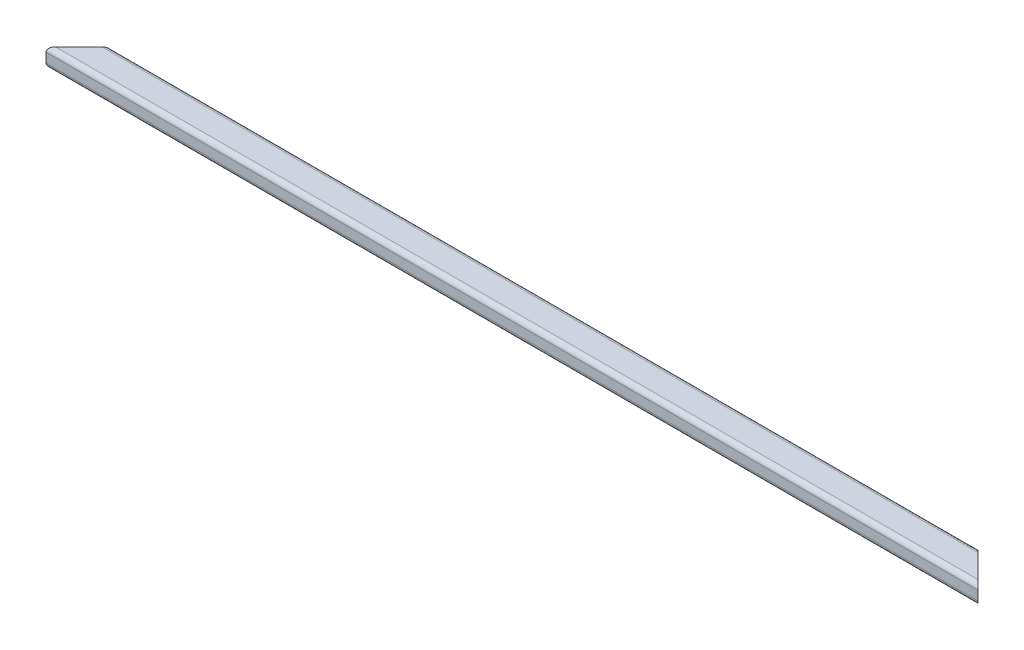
ISO-10303-21;
HEADER;
FILE_DESCRIPTION(('STEP AP214'),'2;1');
FILE_NAME('part.step','',(''),(''),'','','');
FILE_SCHEMA(('AUTOMOTIVE_DESIGN { 1 0 10303 214 1 1 1 1 }'));
ENDSEC;
DATA;
#1=APPLICATION_CONTEXT('core data for automotive mechanical design processes');
#2=APPLICATION_PROTOCOL_DEFINITION('international standard','automotive_design',2000,#1);
#3=PRODUCT_CONTEXT('',#1,'mechanical');
#4=PRODUCT('Part','Part','',(#3));
#5=PRODUCT_RELATED_PRODUCT_CATEGORY('part','',(#4));
#6=PRODUCT_DEFINITION_FORMATION('','',#4);
#7=PRODUCT_DEFINITION_CONTEXT('part definition',#1,'design');
#8=PRODUCT_DEFINITION('design','',#6,#7);
#9=PRODUCT_DEFINITION_SHAPE('','',#8);
#10=(LENGTH_UNIT() NAMED_UNIT(*) SI_UNIT(.MILLI.,.METRE.));
#11=(NAMED_UNIT(*) PLANE_ANGLE_UNIT() SI_UNIT($,.RADIAN.));
#12=(NAMED_UNIT(*) SI_UNIT($,.STERADIAN.) SOLID_ANGLE_UNIT());
#13=UNCERTAINTY_MEASURE_WITH_UNIT(LENGTH_MEASURE(1.E-05),#10,'distance_accuracy_value','');
#14=(GEOMETRIC_REPRESENTATION_CONTEXT(3) GLOBAL_UNCERTAINTY_ASSIGNED_CONTEXT((#13)) GLOBAL_UNIT_ASSIGNED_CONTEXT((#10,
#11,#12)) REPRESENTATION_CONTEXT('',''));
#15=CARTESIAN_POINT('',(0.,0.,0.));
#16=DIRECTION('',(0.,0.,1.));
#17=DIRECTION('',(1.,0.,0.));
#18=AXIS2_PLACEMENT_3D('',#15,#16,#17);
#19=CARTESIAN_POINT('',(1000.,5.,-12.5));
#20=DIRECTION('',(-1.,0.,0.));
#21=DIRECTION('',(0.,0.,1.));
#22=AXIS2_PLACEMENT_3D('',#19,#20,#21);
#23=CYLINDRICAL_SURFACE('',#22,5.);
#24=DIRECTION('',(-1.,0.,0.));
#25=VECTOR('',#24,1.);
#26=CARTESIAN_POINT('',(1000.,5.,-17.5));
#27=LINE('',#26,#25);
#28=CARTESIAN_POINT('',(965.,5.,-17.5));
#29=VERTEX_POINT('',#28);
#30=CARTESIAN_POINT('',(34.9999999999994,5.,-17.5));
#31=VERTEX_POINT('',#30);
#32=EDGE_CURVE('E220',#29,#31,#27,.T.);
#33=ORIENTED_EDGE('',*,*,#32,.T.);
#34=CARTESIAN_POINT('',(29.9999999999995,5.,-12.5));
#35=DIRECTION('',(0.707106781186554,0.,0.707106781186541));
#36=DIRECTION('',(-0.707106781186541,0.,0.707106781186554));
#37=AXIS2_PLACEMENT_3D('',#34,#35,#36);
#38=ELLIPSE('',#37,7.07106781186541,5.);
#39=CARTESIAN_POINT('',(29.9999999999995,10.,-12.5));
#40=VERTEX_POINT('',#39);
#41=EDGE_CURVE('E45',#31,#40,#38,.T.);
#42=ORIENTED_EDGE('',*,*,#41,.T.);
#43=DIRECTION('',(-1.,0.,0.));
#44=VECTOR('',#43,1.);
#45=CARTESIAN_POINT('',(1000.,10.,-12.5));
#46=LINE('',#45,#44);
#47=CARTESIAN_POINT('',(970.,10.,-12.5));
#48=VERTEX_POINT('',#47);
#49=EDGE_CURVE('E159',#48,#40,#46,.T.);
#50=ORIENTED_EDGE('',*,*,#49,.F.);
#51=CARTESIAN_POINT('',(970.,5.,-12.5));
#52=DIRECTION('',(-0.707106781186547,0.,0.707106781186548));
#53=DIRECTION('',(-0.707106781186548,0.,-0.707106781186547));
#54=AXIS2_PLACEMENT_3D('',#51,#52,#53);
#55=ELLIPSE('',#54,7.07106781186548,5.);
#56=EDGE_CURVE('E199',#48,#29,#55,.T.);
#57=ORIENTED_EDGE('',*,*,#56,.T.);
#58=EDGE_LOOP('',(#33,#42,#50,#57));
#59=FACE_BOUND('',#58,.T.);
#60=ADVANCED_FACE('F31',(#59),#23,.T.);
#61=CARTESIAN_POINT('',(1000.,10.,12.5));
#62=DIRECTION('',(0.,-1.,0.));
#63=DIRECTION('',(0.,0.,-1.));
#64=AXIS2_PLACEMENT_3D('',#61,#62,#63);
#65=PLANE('',#64);
#66=ORIENTED_EDGE('',*,*,#49,.T.);
#67=DIRECTION('',(0.707106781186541,0.,-0.707106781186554));
#68=VECTOR('',#67,1.);
#69=CARTESIAN_POINT('',(0.,10.,17.5));
#70=LINE('',#69,#68);
#71=CARTESIAN_POINT('',(4.9999999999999,10.,12.5));
#72=VERTEX_POINT('',#71);
#73=EDGE_CURVE('E143',#72,#40,#70,.T.);
#74=ORIENTED_EDGE('',*,*,#73,.F.);
#75=DIRECTION('',(-1.,0.,0.));
#76=VECTOR('',#75,1.);
#77=CARTESIAN_POINT('',(1000.,10.,12.5));
#78=LINE('',#77,#76);
#79=CARTESIAN_POINT('',(995.,10.,12.5));
#80=VERTEX_POINT('',#79);
#81=EDGE_CURVE('E157',#80,#72,#78,.T.);
#82=ORIENTED_EDGE('',*,*,#81,.F.);
#83=DIRECTION('',(0.707106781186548,0.,0.707106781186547));
#84=VECTOR('',#83,1.);
#85=CARTESIAN_POINT('',(1000.,10.,17.5));
#86=LINE('',#85,#84);
#87=EDGE_CURVE('E243',#48,#80,#86,.T.);
#88=ORIENTED_EDGE('',*,*,#87,.F.);
#89=EDGE_LOOP('',(#66,#74,#82,#88));
#90=FACE_BOUND('',#89,.T.);
#91=ADVANCED_FACE('F155',(#90),#65,.F.);
#92=CARTESIAN_POINT('',(1000.,5.,12.5));
#93=DIRECTION('',(-1.,0.,0.));
#94=DIRECTION('',(0.,0.,1.));
#95=AXIS2_PLACEMENT_3D('',#92,#93,#94);
#96=CYLINDRICAL_SURFACE('',#95,5.);
#97=ORIENTED_EDGE('',*,*,#81,.T.);
#98=CARTESIAN_POINT('',(4.99999999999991,5.,12.5));
#99=DIRECTION('',(0.707106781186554,0.,0.707106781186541));
#100=DIRECTION('',(-0.707106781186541,0.,0.707106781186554));
#101=AXIS2_PLACEMENT_3D('',#98,#99,#100);
#102=ELLIPSE('',#101,7.07106781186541,5.);
#103=CARTESIAN_POINT('',(0.,5.,17.5));
#104=VERTEX_POINT('',#103);
#105=EDGE_CURVE('E140',#72,#104,#102,.T.);
#106=ORIENTED_EDGE('',*,*,#105,.T.);
#107=DIRECTION('',(-1.,0.,0.));
#108=VECTOR('',#107,1.);
#109=CARTESIAN_POINT('',(1000.,5.,17.5));
#110=LINE('',#109,#108);
#111=CARTESIAN_POINT('',(1000.,5.,17.5));
#112=VERTEX_POINT('',#111);
#113=EDGE_CURVE('E165',#112,#104,#110,.T.);
#114=ORIENTED_EDGE('',*,*,#113,.F.);
#115=CARTESIAN_POINT('',(995.,5.,12.5));
#116=DIRECTION('',(-0.707106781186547,0.,0.707106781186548));
#117=DIRECTION('',(-0.707106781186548,0.,-0.707106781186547));
#118=AXIS2_PLACEMENT_3D('',#115,#116,#117);
#119=ELLIPSE('',#118,7.07106781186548,5.);
#120=EDGE_CURVE('E164',#112,#80,#119,.T.);
#121=ORIENTED_EDGE('',*,*,#120,.T.);
#122=EDGE_LOOP('',(#97,#106,#114,#121));
#123=FACE_BOUND('',#122,.T.);
#124=ADVANCED_FACE('F163',(#123),#96,.T.);
#125=CARTESIAN_POINT('',(1000.,5.,17.5));
#126=DIRECTION('',(0.,0.,-1.));
#127=DIRECTION('',(-1.,0.,0.));
#128=AXIS2_PLACEMENT_3D('',#125,#126,#127);
#129=PLANE('',#128);
#130=DIRECTION('',(0.,-1.,0.));
#131=VECTOR('',#130,1.);
#132=CARTESIAN_POINT('',(0.,5.,17.5));
#133=LINE('',#132,#131);
#134=CARTESIAN_POINT('',(0.,-5.,17.5));
#135=VERTEX_POINT('',#134);
#136=EDGE_CURVE('E145',#104,#135,#133,.T.);
#137=ORIENTED_EDGE('',*,*,#136,.T.);
#138=DIRECTION('',(-1.,0.,0.));
#139=VECTOR('',#138,1.);
#140=CARTESIAN_POINT('',(1000.,-5.,17.5));
#141=LINE('',#140,#139);
#142=CARTESIAN_POINT('',(1000.,-5.,17.5));
#143=VERTEX_POINT('',#142);
#144=EDGE_CURVE('E168',#143,#135,#141,.T.);
#145=ORIENTED_EDGE('',*,*,#144,.F.);
#146=DIRECTION('',(0.,-1.,0.));
#147=VECTOR('',#146,1.);
#148=CARTESIAN_POINT('',(1000.,5.,17.5));
#149=LINE('',#148,#147);
#150=EDGE_CURVE('E218',#112,#143,#149,.T.);
#151=ORIENTED_EDGE('',*,*,#150,.F.);
#152=ORIENTED_EDGE('',*,*,#113,.T.);
#153=EDGE_LOOP('',(#137,#145,#151,#152));
#154=FACE_BOUND('',#153,.T.);
#155=ADVANCED_FACE('F241',(#154),#129,.F.);
#156=CARTESIAN_POINT('',(1000.,-5.,12.5));
#157=DIRECTION('',(-1.,0.,0.));
#158=DIRECTION('',(0.,0.,1.));
#159=AXIS2_PLACEMENT_3D('',#156,#157,#158);
#160=CYLINDRICAL_SURFACE('',#159,5.);
#161=ORIENTED_EDGE('',*,*,#144,.T.);
#162=CARTESIAN_POINT('',(4.99999999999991,-5.,12.5));
#163=DIRECTION('',(0.707106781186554,0.,0.707106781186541));
#164=DIRECTION('',(-0.707106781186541,0.,0.707106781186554));
#165=AXIS2_PLACEMENT_3D('',#162,#163,#164);
#166=ELLIPSE('',#165,7.07106781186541,5.);
#167=CARTESIAN_POINT('',(4.99999999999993,-10.,12.5));
#168=VERTEX_POINT('',#167);
#169=EDGE_CURVE('E150',#135,#168,#166,.T.);
#170=ORIENTED_EDGE('',*,*,#169,.T.);
#171=DIRECTION('',(-1.,0.,0.));
#172=VECTOR('',#171,1.);
#173=CARTESIAN_POINT('',(1000.,-10.,12.5));
#174=LINE('',#173,#172);
#175=CARTESIAN_POINT('',(995.,-10.,12.5));
#176=VERTEX_POINT('',#175);
#177=EDGE_CURVE('E229',#176,#168,#174,.T.);
#178=ORIENTED_EDGE('',*,*,#177,.F.);
#179=CARTESIAN_POINT('',(995.,-5.,12.5));
#180=DIRECTION('',(-0.707106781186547,0.,0.707106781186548));
#181=DIRECTION('',(-0.707106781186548,0.,-0.707106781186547));
#182=AXIS2_PLACEMENT_3D('',#179,#180,#181);
#183=ELLIPSE('',#182,7.07106781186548,5.);
#184=EDGE_CURVE('E238',#176,#143,#183,.T.);
#185=ORIENTED_EDGE('',*,*,#184,.T.);
#186=EDGE_LOOP('',(#161,#170,#178,#185));
#187=FACE_BOUND('',#186,.T.);
#188=ADVANCED_FACE('F236',(#187),#160,.T.);
#189=CARTESIAN_POINT('',(1000.,-10.,12.5));
#190=DIRECTION('',(0.,1.,0.));
#191=DIRECTION('',(0.,0.,1.));
#192=AXIS2_PLACEMENT_3D('',#189,#190,#191);
#193=PLANE('',#192);
#194=ORIENTED_EDGE('',*,*,#177,.T.);
#195=DIRECTION('',(0.707106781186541,0.,-0.707106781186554));
#196=VECTOR('',#195,1.);
#197=CARTESIAN_POINT('',(0.,-10.,17.5));
#198=LINE('',#197,#196);
#199=CARTESIAN_POINT('',(29.9999999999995,-10.,-12.5));
#200=VERTEX_POINT('',#199);
#201=EDGE_CURVE('E160',#168,#200,#198,.T.);
#202=ORIENTED_EDGE('',*,*,#201,.T.);
#203=DIRECTION('',(-1.,0.,0.));
#204=VECTOR('',#203,1.);
#205=CARTESIAN_POINT('',(1000.,-10.,-12.5));
#206=LINE('',#205,#204);
#207=CARTESIAN_POINT('',(970.,-10.,-12.5));
#208=VERTEX_POINT('',#207);
#209=EDGE_CURVE('E226',#208,#200,#206,.T.);
#210=ORIENTED_EDGE('',*,*,#209,.F.);
#211=DIRECTION('',(0.707106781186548,0.,0.707106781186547));
#212=VECTOR('',#211,1.);
#213=CARTESIAN_POINT('',(1000.,-10.,17.5));
#214=LINE('',#213,#212);
#215=EDGE_CURVE('E262',#208,#176,#214,.T.);
#216=ORIENTED_EDGE('',*,*,#215,.T.);
#217=EDGE_LOOP('',(#194,#202,#210,#216));
#218=FACE_BOUND('',#217,.T.);
#219=ADVANCED_FACE('F288',(#218),#193,.F.);
#220=CARTESIAN_POINT('',(1000.,-5.,-12.5));
#221=DIRECTION('',(-1.,0.,0.));
#222=DIRECTION('',(0.,0.,1.));
#223=AXIS2_PLACEMENT_3D('',#220,#221,#222);
#224=CYLINDRICAL_SURFACE('',#223,5.);
#225=ORIENTED_EDGE('',*,*,#209,.T.);
#226=CARTESIAN_POINT('',(29.9999999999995,-5.,-12.5));
#227=DIRECTION('',(0.707106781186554,0.,0.707106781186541));
#228=DIRECTION('',(-0.707106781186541,0.,0.707106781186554));
#229=AXIS2_PLACEMENT_3D('',#226,#227,#228);
#230=ELLIPSE('',#229,7.07106781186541,5.);
#231=CARTESIAN_POINT('',(34.9999999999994,-5.,-17.5));
#232=VERTEX_POINT('',#231);
#233=EDGE_CURVE('E267',#200,#232,#230,.T.);
#234=ORIENTED_EDGE('',*,*,#233,.T.);
#235=DIRECTION('',(-1.,0.,0.));
#236=VECTOR('',#235,1.);
#237=CARTESIAN_POINT('',(1000.,-5.,-17.5));
#238=LINE('',#237,#236);
#239=CARTESIAN_POINT('',(965.,-5.,-17.5));
#240=VERTEX_POINT('',#239);
#241=EDGE_CURVE('E223',#240,#232,#238,.T.);
#242=ORIENTED_EDGE('',*,*,#241,.F.);
#243=CARTESIAN_POINT('',(970.,-5.,-12.5));
#244=DIRECTION('',(-0.707106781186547,0.,0.707106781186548));
#245=DIRECTION('',(-0.707106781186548,0.,-0.707106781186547));
#246=AXIS2_PLACEMENT_3D('',#243,#244,#245);
#247=ELLIPSE('',#246,7.07106781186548,5.);
#248=EDGE_CURVE('E246',#240,#208,#247,.T.);
#249=ORIENTED_EDGE('',*,*,#248,.T.);
#250=EDGE_LOOP('',(#225,#234,#242,#249));
#251=FACE_BOUND('',#250,.T.);
#252=ADVANCED_FACE('F290',(#251),#224,.T.);
#253=CARTESIAN_POINT('',(1000.,5.,-17.5));
#254=DIRECTION('',(0.,0.,1.));
#255=DIRECTION('',(1.,0.,0.));
#256=AXIS2_PLACEMENT_3D('',#253,#254,#255);
#257=PLANE('',#256);
#258=ORIENTED_EDGE('',*,*,#241,.T.);
#259=DIRECTION('',(0.,1.,0.));
#260=VECTOR('',#259,1.);
#261=CARTESIAN_POINT('',(34.9999999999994,-10.,-17.5));
#262=LINE('',#261,#260);
#263=EDGE_CURVE('E283',#232,#31,#262,.T.);
#264=ORIENTED_EDGE('',*,*,#263,.T.);
#265=ORIENTED_EDGE('',*,*,#32,.F.);
#266=DIRECTION('',(0.,1.,0.));
#267=VECTOR('',#266,1.);
#268=CARTESIAN_POINT('',(965.,-10.,-17.5));
#269=LINE('',#268,#267);
#270=EDGE_CURVE('E192',#240,#29,#269,.T.);
#271=ORIENTED_EDGE('',*,*,#270,.F.);
#272=EDGE_LOOP('',(#258,#264,#265,#271));
#273=FACE_BOUND('',#272,.T.);
#274=ADVANCED_FACE('F295',(#273),#257,.F.);
#275=CARTESIAN_POINT('',(1000.,5.,12.5));
#276=DIRECTION('',(-1.,0.,0.));
#277=DIRECTION('',(0.,0.,1.));
#278=AXIS2_PLACEMENT_3D('',#275,#276,#277);
#279=CYLINDRICAL_SURFACE('',#278,2.5);
#280=CARTESIAN_POINT('',(4.99999999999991,5.,12.5));
#281=DIRECTION('',(0.707106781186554,0.,0.707106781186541));
#282=DIRECTION('',(-0.707106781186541,0.,0.707106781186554));
#283=AXIS2_PLACEMENT_3D('',#280,#281,#282);
#284=ELLIPSE('',#283,3.53553390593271,2.5);
#285=CARTESIAN_POINT('',(4.99999999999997,7.5,12.5));
#286=VERTEX_POINT('',#285);
#287=CARTESIAN_POINT('',(2.49999999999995,5.,15.));
#288=VERTEX_POINT('',#287);
#289=EDGE_CURVE('E270',#286,#288,#284,.T.);
#290=ORIENTED_EDGE('',*,*,#289,.F.);
#291=DIRECTION('',(-1.,0.,0.));
#292=VECTOR('',#291,1.);
#293=CARTESIAN_POINT('',(1000.,7.5,12.5));
#294=LINE('',#293,#292);
#295=CARTESIAN_POINT('',(995.,7.5,12.5));
#296=VERTEX_POINT('',#295);
#297=EDGE_CURVE('E195',#296,#286,#294,.T.);
#298=ORIENTED_EDGE('',*,*,#297,.F.);
#299=CARTESIAN_POINT('',(995.,5.,12.5));
#300=DIRECTION('',(-0.707106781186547,0.,0.707106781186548));
#301=DIRECTION('',(-0.707106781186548,0.,-0.707106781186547));
#302=AXIS2_PLACEMENT_3D('',#299,#300,#301);
#303=ELLIPSE('',#302,3.53553390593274,2.5);
#304=CARTESIAN_POINT('',(997.5,5.,15.));
#305=VERTEX_POINT('',#304);
#306=EDGE_CURVE('E179',#305,#296,#303,.T.);
#307=ORIENTED_EDGE('',*,*,#306,.F.);
#308=DIRECTION('',(-1.,0.,0.));
#309=VECTOR('',#308,1.);
#310=CARTESIAN_POINT('',(1000.,5.,15.));
#311=LINE('',#310,#309);
#312=EDGE_CURVE('E214',#305,#288,#311,.T.);
#313=ORIENTED_EDGE('',*,*,#312,.T.);
#314=EDGE_LOOP('',(#290,#298,#307,#313));
#315=FACE_BOUND('',#314,.T.);
#316=ADVANCED_FACE('F316',(#315),#279,.F.);
#317=CARTESIAN_POINT('',(1000.,5.,15.));
#318=DIRECTION('',(0.,0.,-1.));
#319=DIRECTION('',(-1.,0.,0.));
#320=AXIS2_PLACEMENT_3D('',#317,#318,#319);
#321=PLANE('',#320);
#322=DIRECTION('',(0.,-1.,0.));
#323=VECTOR('',#322,1.);
#324=CARTESIAN_POINT('',(2.49999999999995,5.,15.));
#325=LINE('',#324,#323);
#326=CARTESIAN_POINT('',(2.49999999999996,-5.,15.));
#327=VERTEX_POINT('',#326);
#328=EDGE_CURVE('E272',#288,#327,#325,.T.);
#329=ORIENTED_EDGE('',*,*,#328,.F.);
#330=ORIENTED_EDGE('',*,*,#312,.F.);
#331=DIRECTION('',(0.,1.,0.));
#332=VECTOR('',#331,1.);
#333=CARTESIAN_POINT('',(997.5,5.,15.));
#334=LINE('',#333,#332);
#335=CARTESIAN_POINT('',(997.5,-5.,15.));
#336=VERTEX_POINT('',#335);
#337=EDGE_CURVE('E252',#336,#305,#334,.T.);
#338=ORIENTED_EDGE('',*,*,#337,.F.);
#339=DIRECTION('',(-1.,0.,0.));
#340=VECTOR('',#339,1.);
#341=CARTESIAN_POINT('',(1000.,-5.,15.));
#342=LINE('',#341,#340);
#343=EDGE_CURVE('E211',#336,#327,#342,.T.);
#344=ORIENTED_EDGE('',*,*,#343,.T.);
#345=EDGE_LOOP('',(#329,#330,#338,#344));
#346=FACE_BOUND('',#345,.T.);
#347=ADVANCED_FACE('F319',(#346),#321,.T.);
#348=CARTESIAN_POINT('',(1000.,-5.,12.5));
#349=DIRECTION('',(-1.,0.,0.));
#350=DIRECTION('',(0.,0.,1.));
#351=AXIS2_PLACEMENT_3D('',#348,#349,#350);
#352=CYLINDRICAL_SURFACE('',#351,2.5);
#353=CARTESIAN_POINT('',(4.99999999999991,-5.,12.5));
#354=DIRECTION('',(0.707106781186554,0.,0.707106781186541));
#355=DIRECTION('',(-0.707106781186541,0.,0.707106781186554));
#356=AXIS2_PLACEMENT_3D('',#353,#354,#355);
#357=ELLIPSE('',#356,3.53553390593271,2.5);
#358=CARTESIAN_POINT('',(4.99999999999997,-7.5,12.5));
#359=VERTEX_POINT('',#358);
#360=EDGE_CURVE('E274',#327,#359,#357,.T.);
#361=ORIENTED_EDGE('',*,*,#360,.F.);
#362=ORIENTED_EDGE('',*,*,#343,.F.);
#363=CARTESIAN_POINT('',(995.,-5.,12.5));
#364=DIRECTION('',(-0.707106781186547,0.,0.707106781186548));
#365=DIRECTION('',(-0.707106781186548,0.,-0.707106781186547));
#366=AXIS2_PLACEMENT_3D('',#363,#364,#365);
#367=ELLIPSE('',#366,3.53553390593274,2.5);
#368=CARTESIAN_POINT('',(995.,-7.5,12.5));
#369=VERTEX_POINT('',#368);
#370=EDGE_CURVE('E254',#369,#336,#367,.T.);
#371=ORIENTED_EDGE('',*,*,#370,.F.);
#372=DIRECTION('',(-1.,0.,0.));
#373=VECTOR('',#372,1.);
#374=CARTESIAN_POINT('',(1000.,-7.5,12.5));
#375=LINE('',#374,#373);
#376=EDGE_CURVE('E208',#369,#359,#375,.T.);
#377=ORIENTED_EDGE('',*,*,#376,.T.);
#378=EDGE_LOOP('',(#361,#362,#371,#377));
#379=FACE_BOUND('',#378,.T.);
#380=ADVANCED_FACE('F323',(#379),#352,.F.);
#381=CARTESIAN_POINT('',(1000.,-7.5,12.5));
#382=DIRECTION('',(0.,1.,0.));
#383=DIRECTION('',(0.,0.,1.));
#384=AXIS2_PLACEMENT_3D('',#381,#382,#383);
#385=PLANE('',#384);
#386=DIRECTION('',(0.707106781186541,0.,-0.707106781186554));
#387=VECTOR('',#386,1.);
#388=CARTESIAN_POINT('',(502.499999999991,-7.5,-485.));
#389=LINE('',#388,#387);
#390=CARTESIAN_POINT('',(29.9999999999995,-7.5,-12.5));
#391=VERTEX_POINT('',#390);
#392=EDGE_CURVE('E276',#359,#391,#389,.T.);
#393=ORIENTED_EDGE('',*,*,#392,.F.);
#394=ORIENTED_EDGE('',*,*,#376,.F.);
#395=DIRECTION('',(0.707106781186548,0.,0.707106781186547));
#396=VECTOR('',#395,1.);
#397=CARTESIAN_POINT('',(997.5,-7.5,15.));
#398=LINE('',#397,#396);
#399=CARTESIAN_POINT('',(970.,-7.5,-12.5));
#400=VERTEX_POINT('',#399);
#401=EDGE_CURVE('E256',#400,#369,#398,.T.);
#402=ORIENTED_EDGE('',*,*,#401,.F.);
#403=DIRECTION('',(-1.,0.,0.));
#404=VECTOR('',#403,1.);
#405=CARTESIAN_POINT('',(1000.,-7.5,-12.5));
#406=LINE('',#405,#404);
#407=EDGE_CURVE('E205',#400,#391,#406,.T.);
#408=ORIENTED_EDGE('',*,*,#407,.T.);
#409=EDGE_LOOP('',(#393,#394,#402,#408));
#410=FACE_BOUND('',#409,.T.);
#411=ADVANCED_FACE('F327',(#410),#385,.T.);
#412=CARTESIAN_POINT('',(1000.,-5.,-12.5));
#413=DIRECTION('',(-1.,0.,0.));
#414=DIRECTION('',(0.,0.,1.));
#415=AXIS2_PLACEMENT_3D('',#412,#413,#414);
#416=CYLINDRICAL_SURFACE('',#415,2.5);
#417=CARTESIAN_POINT('',(29.9999999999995,-5.,-12.5));
#418=DIRECTION('',(0.707106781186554,0.,0.707106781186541));
#419=DIRECTION('',(-0.707106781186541,0.,0.707106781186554));
#420=AXIS2_PLACEMENT_3D('',#417,#418,#419);
#421=ELLIPSE('',#420,3.53553390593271,2.5);
#422=CARTESIAN_POINT('',(32.4999999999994,-5.,-15.));
#423=VERTEX_POINT('',#422);
#424=EDGE_CURVE('E278',#391,#423,#421,.T.);
#425=ORIENTED_EDGE('',*,*,#424,.F.);
#426=ORIENTED_EDGE('',*,*,#407,.F.);
#427=CARTESIAN_POINT('',(970.,-5.,-12.5));
#428=DIRECTION('',(-0.707106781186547,0.,0.707106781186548));
#429=DIRECTION('',(-0.707106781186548,0.,-0.707106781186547));
#430=AXIS2_PLACEMENT_3D('',#427,#428,#429);
#431=ELLIPSE('',#430,3.53553390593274,2.5);
#432=CARTESIAN_POINT('',(967.5,-5.,-15.));
#433=VERTEX_POINT('',#432);
#434=EDGE_CURVE('E258',#433,#400,#431,.T.);
#435=ORIENTED_EDGE('',*,*,#434,.F.);
#436=DIRECTION('',(-1.,0.,0.));
#437=VECTOR('',#436,1.);
#438=CARTESIAN_POINT('',(1000.,-5.,-15.));
#439=LINE('',#438,#437);
#440=EDGE_CURVE('E197',#433,#423,#439,.T.);
#441=ORIENTED_EDGE('',*,*,#440,.T.);
#442=EDGE_LOOP('',(#425,#426,#435,#441));
#443=FACE_BOUND('',#442,.T.);
#444=ADVANCED_FACE('F331',(#443),#416,.F.);
#445=CARTESIAN_POINT('',(1000.,5.,-15.));
#446=DIRECTION('',(0.,0.,1.));
#447=DIRECTION('',(1.,0.,0.));
#448=AXIS2_PLACEMENT_3D('',#445,#446,#447);
#449=PLANE('',#448);
#450=DIRECTION('',(0.,1.,0.));
#451=VECTOR('',#450,1.);
#452=CARTESIAN_POINT('',(32.4999999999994,5.,-15.));
#453=LINE('',#452,#451);
#454=CARTESIAN_POINT('',(32.4999999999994,5.,-15.));
#455=VERTEX_POINT('',#454);
#456=EDGE_CURVE('E280',#423,#455,#453,.T.);
#457=ORIENTED_EDGE('',*,*,#456,.F.);
#458=ORIENTED_EDGE('',*,*,#440,.F.);
#459=DIRECTION('',(0.,-1.,0.));
#460=VECTOR('',#459,1.);
#461=CARTESIAN_POINT('',(967.5,5.,-15.));
#462=LINE('',#461,#460);
#463=CARTESIAN_POINT('',(967.5,5.,-15.));
#464=VERTEX_POINT('',#463);
#465=EDGE_CURVE('E191',#464,#433,#462,.T.);
#466=ORIENTED_EDGE('',*,*,#465,.F.);
#467=DIRECTION('',(-1.,0.,0.));
#468=VECTOR('',#467,1.);
#469=CARTESIAN_POINT('',(1000.,5.,-15.));
#470=LINE('',#469,#468);
#471=EDGE_CURVE('E190',#464,#455,#470,.T.);
#472=ORIENTED_EDGE('',*,*,#471,.T.);
#473=EDGE_LOOP('',(#457,#458,#466,#472));
#474=FACE_BOUND('',#473,.T.);
#475=ADVANCED_FACE('F335',(#474),#449,.T.);
#476=CARTESIAN_POINT('',(1000.,5.,-12.5));
#477=DIRECTION('',(-1.,0.,0.));
#478=DIRECTION('',(0.,0.,1.));
#479=AXIS2_PLACEMENT_3D('',#476,#477,#478);
#480=CYLINDRICAL_SURFACE('',#479,2.5);
#481=CARTESIAN_POINT('',(29.9999999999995,5.,-12.5));
#482=DIRECTION('',(0.707106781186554,0.,0.707106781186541));
#483=DIRECTION('',(-0.707106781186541,0.,0.707106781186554));
#484=AXIS2_PLACEMENT_3D('',#481,#482,#483);
#485=ELLIPSE('',#484,3.53553390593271,2.5);
#486=CARTESIAN_POINT('',(29.9999999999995,7.5,-12.5));
#487=VERTEX_POINT('',#486);
#488=EDGE_CURVE('E52',#455,#487,#485,.T.);
#489=ORIENTED_EDGE('',*,*,#488,.F.);
#490=ORIENTED_EDGE('',*,*,#471,.F.);
#491=CARTESIAN_POINT('',(970.,5.,-12.5));
#492=DIRECTION('',(-0.707106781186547,0.,0.707106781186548));
#493=DIRECTION('',(-0.707106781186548,0.,-0.707106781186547));
#494=AXIS2_PLACEMENT_3D('',#491,#492,#493);
#495=ELLIPSE('',#494,3.53553390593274,2.5);
#496=CARTESIAN_POINT('',(970.,7.5,-12.5));
#497=VERTEX_POINT('',#496);
#498=EDGE_CURVE('E176',#497,#464,#495,.T.);
#499=ORIENTED_EDGE('',*,*,#498,.F.);
#500=DIRECTION('',(-1.,0.,0.));
#501=VECTOR('',#500,1.);
#502=CARTESIAN_POINT('',(1000.,7.5,-12.5));
#503=LINE('',#502,#501);
#504=EDGE_CURVE('E188',#497,#487,#503,.T.);
#505=ORIENTED_EDGE('',*,*,#504,.T.);
#506=EDGE_LOOP('',(#489,#490,#499,#505));
#507=FACE_BOUND('',#506,.T.);
#508=ADVANCED_FACE('F187',(#507),#480,.F.);
#509=CARTESIAN_POINT('',(1000.,7.5,12.5));
#510=DIRECTION('',(0.,-1.,0.));
#511=DIRECTION('',(0.,0.,-1.));
#512=AXIS2_PLACEMENT_3D('',#509,#510,#511);
#513=PLANE('',#512);
#514=DIRECTION('',(-0.707106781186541,0.,0.707106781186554));
#515=VECTOR('',#514,1.);
#516=CARTESIAN_POINT('',(502.499999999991,7.5,-485.));
#517=LINE('',#516,#515);
#518=EDGE_CURVE('E11',#487,#286,#517,.T.);
#519=ORIENTED_EDGE('',*,*,#518,.F.);
#520=ORIENTED_EDGE('',*,*,#504,.F.);
#521=DIRECTION('',(-0.707106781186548,0.,-0.707106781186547));
#522=VECTOR('',#521,1.);
#523=CARTESIAN_POINT('',(997.5,7.5,15.));
#524=LINE('',#523,#522);
#525=EDGE_CURVE('E38',#296,#497,#524,.T.);
#526=ORIENTED_EDGE('',*,*,#525,.F.);
#527=ORIENTED_EDGE('',*,*,#297,.T.);
#528=EDGE_LOOP('',(#519,#520,#526,#527));
#529=FACE_BOUND('',#528,.T.);
#530=ADVANCED_FACE('F194',(#529),#513,.T.);
#531=CARTESIAN_POINT('',(1000.,-10.,17.5));
#532=DIRECTION('',(-0.707106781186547,0.,0.707106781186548));
#533=DIRECTION('',(0.707106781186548,0.,0.707106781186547));
#534=AXIS2_PLACEMENT_3D('',#531,#532,#533);
#535=PLANE('',#534);
#536=ORIENTED_EDGE('',*,*,#306,.T.);
#537=ORIENTED_EDGE('',*,*,#525,.T.);
#538=ORIENTED_EDGE('',*,*,#498,.T.);
#539=ORIENTED_EDGE('',*,*,#465,.T.);
#540=ORIENTED_EDGE('',*,*,#434,.T.);
#541=ORIENTED_EDGE('',*,*,#401,.T.);
#542=ORIENTED_EDGE('',*,*,#370,.T.);
#543=ORIENTED_EDGE('',*,*,#337,.T.);
#544=EDGE_LOOP('',(#536,#537,#538,#539,#540,#541,#542,#543));
#545=FACE_BOUND('',#544,.T.);
#546=ORIENTED_EDGE('',*,*,#87,.T.);
#547=ORIENTED_EDGE('',*,*,#120,.F.);
#548=ORIENTED_EDGE('',*,*,#150,.T.);
#549=ORIENTED_EDGE('',*,*,#184,.F.);
#550=ORIENTED_EDGE('',*,*,#215,.F.);
#551=ORIENTED_EDGE('',*,*,#248,.F.);
#552=ORIENTED_EDGE('',*,*,#270,.T.);
#553=ORIENTED_EDGE('',*,*,#56,.F.);
#554=EDGE_LOOP('',(#546,#547,#548,#549,#550,#551,#552,#553));
#555=FACE_BOUND('',#554,.T.);
#556=ADVANCED_FACE('F174',(#545,#555),#535,.F.);
#557=CARTESIAN_POINT('',(0.,-10.,17.5));
#558=DIRECTION('',(0.707106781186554,0.,0.707106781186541));
#559=DIRECTION('',(0.707106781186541,0.,-0.707106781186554));
#560=AXIS2_PLACEMENT_3D('',#557,#558,#559);
#561=PLANE('',#560);
#562=ORIENTED_EDGE('',*,*,#289,.T.);
#563=ORIENTED_EDGE('',*,*,#328,.T.);
#564=ORIENTED_EDGE('',*,*,#360,.T.);
#565=ORIENTED_EDGE('',*,*,#392,.T.);
#566=ORIENTED_EDGE('',*,*,#424,.T.);
#567=ORIENTED_EDGE('',*,*,#456,.T.);
#568=ORIENTED_EDGE('',*,*,#488,.T.);
#569=ORIENTED_EDGE('',*,*,#518,.T.);
#570=EDGE_LOOP('',(#562,#563,#564,#565,#566,#567,#568,#569));
#571=FACE_BOUND('',#570,.T.);
#572=ORIENTED_EDGE('',*,*,#263,.F.);
#573=ORIENTED_EDGE('',*,*,#233,.F.);
#574=ORIENTED_EDGE('',*,*,#201,.F.);
#575=ORIENTED_EDGE('',*,*,#169,.F.);
#576=ORIENTED_EDGE('',*,*,#136,.F.);
#577=ORIENTED_EDGE('',*,*,#105,.F.);
#578=ORIENTED_EDGE('',*,*,#73,.T.);
#579=ORIENTED_EDGE('',*,*,#41,.F.);
#580=EDGE_LOOP('',(#572,#573,#574,#575,#576,#577,#578,#579));
#581=FACE_BOUND('',#580,.T.);
#582=ADVANCED_FACE('F142',(#571,#581),#561,.F.);
#583=CLOSED_SHELL('',(#60,#91,#124,#155,#188,#219,#252,#274,#316,#347,#380,#411,#444,#475,#508,
#530,#556,#582));
#584=MANIFOLD_SOLID_BREP('B2',#583);
#585=ADVANCED_BREP_SHAPE_REPRESENTATION('',(#18,#584),#14);
#586=SHAPE_DEFINITION_REPRESENTATION(#9,#585);
ENDSEC;
END-ISO-10303-21;
